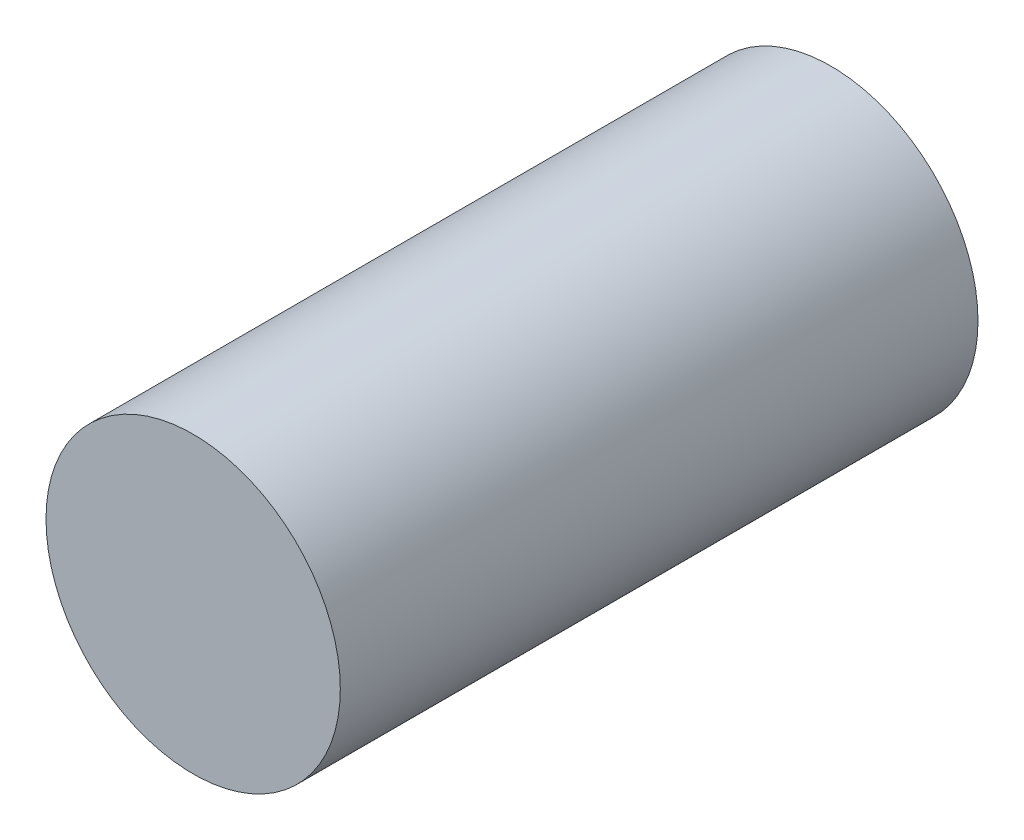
from build123d import *

# Parameters (mm, degrees)
ESQUISSE1_R          = 3
BASE_EXTRUSION_DEPTH = 13


with BuildPart() as part:
    # Esquisse1 → Base-Extrusion (new body)
    with BuildSketch(Plane.XY):
        Circle(ESQUISSE1_R)
    extrude(amount=-BASE_EXTRUSION_DEPTH)


solid = part.part
